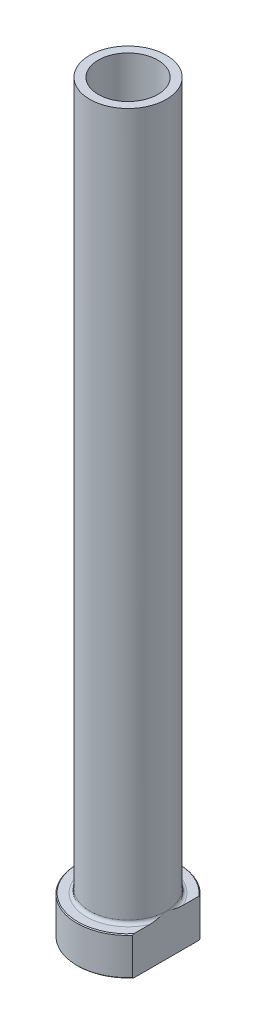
from build123d import *

# Parameters (mm, degrees)
FILLET1_R          = 0.8
CHAMFER1_SIZE      = 0.2
CUT_EXTRUDE1_DEPTH = 176.820931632
CHAMFER2_SIZE      = 0.5


with BuildPart() as part:
    # Sketch1 → Revolve1 (revolve)
    with BuildSketch(Plane.XY, mode=Mode.PRIVATE) as revolve1_sk:
        Polygon((-7, 175), (-9, 175), (-9, 9), (-12, 9), (-12, 0), (-7.25, 0), (-7.25, 108), (-7, 120), align=None)
    revolve(revolve1_sk.sketch.rotate(Axis((0, 92.187680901, 0), (0, -1, 0)), 270), axis=Axis((0, 92.187680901, 0), (0, -1, 0)))

    # Fillet1
    fillet1_edges = [part.edges().sort_by_distance(p)[0] for p in [
        (0, 9, -9),
    ]]
    fillet(fillet1_edges, radius=FILLET1_R)

    # Chamfer1
    chamfer1_edges = [part.edges().sort_by_distance(p)[0] for p in [
        (0, 0, -12),
        (0, 9, -12),
    ]]
    chamfer(chamfer1_edges, length=CHAMFER1_SIZE)

    # Sketch2 → Cut-Extrude1 (cut, through all)
    with BuildSketch(Plane.XZ):
        with BuildLine():
            Line((9, 7.937253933), (9, -7.937253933))
            ThreePointArc((9, -7.937253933), (12, 0), (9, 7.937253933))
        make_face()
    extrude(amount=-CUT_EXTRUDE1_DEPTH, mode=Mode.SUBTRACT)

    # Chamfer2
    chamfer2_edges = [part.edges().sort_by_distance(p)[0] for p in [
        (0, 0, -7.25),
    ]]
    chamfer(chamfer2_edges, length=CHAMFER2_SIZE)


solid = part.part
